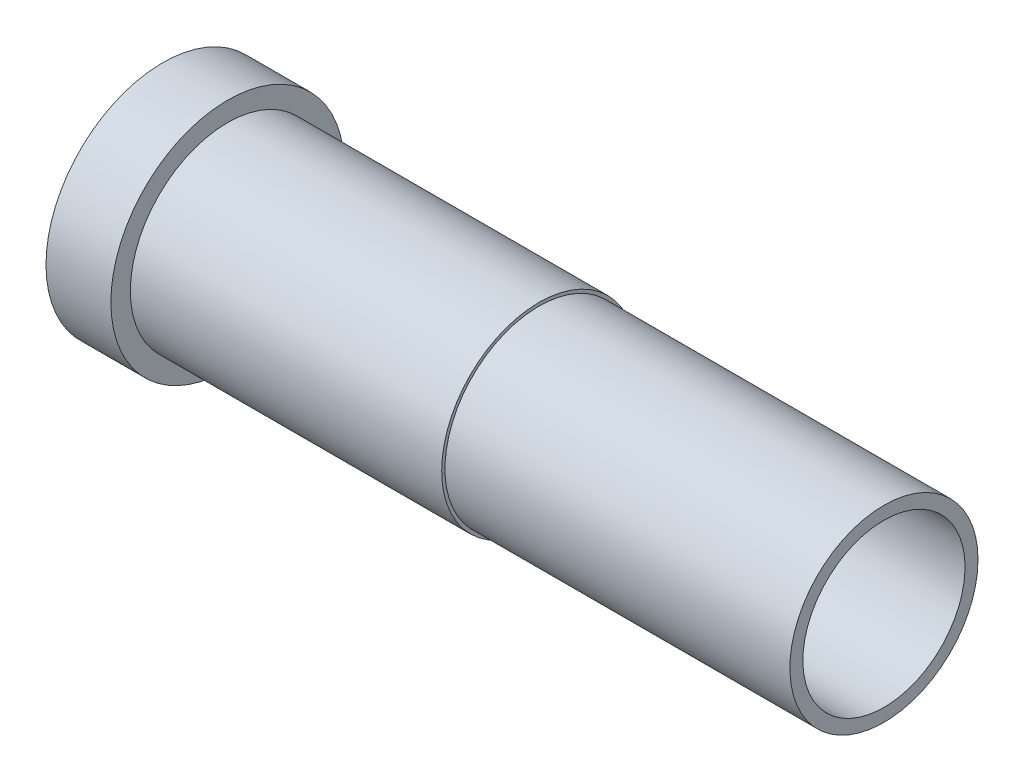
ISO-10303-21;
HEADER;
FILE_DESCRIPTION(('STEP AP214'),'2;1');
FILE_NAME('part.step','',(''),(''),'','','');
FILE_SCHEMA(('AUTOMOTIVE_DESIGN { 1 0 10303 214 1 1 1 1 }'));
ENDSEC;
DATA;
#1=APPLICATION_CONTEXT('core data for automotive mechanical design processes');
#2=APPLICATION_PROTOCOL_DEFINITION('international standard','automotive_design',2000,#1);
#3=PRODUCT_CONTEXT('',#1,'mechanical');
#4=PRODUCT('Part','Part','',(#3));
#5=PRODUCT_RELATED_PRODUCT_CATEGORY('part','',(#4));
#6=PRODUCT_DEFINITION_FORMATION('','',#4);
#7=PRODUCT_DEFINITION_CONTEXT('part definition',#1,'design');
#8=PRODUCT_DEFINITION('design','',#6,#7);
#9=PRODUCT_DEFINITION_SHAPE('','',#8);
#10=(LENGTH_UNIT() NAMED_UNIT(*) SI_UNIT(.MILLI.,.METRE.));
#11=(NAMED_UNIT(*) PLANE_ANGLE_UNIT() SI_UNIT($,.RADIAN.));
#12=(NAMED_UNIT(*) SI_UNIT($,.STERADIAN.) SOLID_ANGLE_UNIT());
#13=UNCERTAINTY_MEASURE_WITH_UNIT(LENGTH_MEASURE(1.E-05),#10,'distance_accuracy_value','');
#14=(GEOMETRIC_REPRESENTATION_CONTEXT(3) GLOBAL_UNCERTAINTY_ASSIGNED_CONTEXT((#13)) GLOBAL_UNIT_ASSIGNED_CONTEXT((#10,
#11,#12)) REPRESENTATION_CONTEXT('',''));
#15=CARTESIAN_POINT('',(0.,0.,0.));
#16=DIRECTION('',(0.,0.,1.));
#17=DIRECTION('',(1.,0.,0.));
#18=AXIS2_PLACEMENT_3D('',#15,#16,#17);
#19=CARTESIAN_POINT('',(-21.6393356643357,0.,0.));
#20=DIRECTION('',(-1.,0.,0.));
#21=DIRECTION('',(0.,0.,1.));
#22=AXIS2_PLACEMENT_3D('',#19,#20,#21);
#23=CYLINDRICAL_SURFACE('',#22,6.25);
#24=CARTESIAN_POINT('',(0.499999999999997,0.,0.));
#25=DIRECTION('',(1.,0.,0.));
#26=DIRECTION('',(0.,0.,-1.));
#27=AXIS2_PLACEMENT_3D('',#24,#25,#26);
#28=CIRCLE('',#27,6.25);
#29=CARTESIAN_POINT('',(0.499999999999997,0.,-6.25));
#30=VERTEX_POINT('',#29);
#31=EDGE_CURVE('E40',#30,#30,#28,.F.);
#32=ORIENTED_EDGE('',*,*,#31,.T.);
#33=EDGE_LOOP('',(#32));
#34=FACE_BOUND('',#33,.T.);
#35=CARTESIAN_POINT('',(55.5866,0.,0.));
#36=DIRECTION('',(1.,0.,0.));
#37=DIRECTION('',(0.,1.,0.));
#38=AXIS2_PLACEMENT_3D('',#35,#36,#37);
#39=CIRCLE('',#38,6.25);
#40=CARTESIAN_POINT('',(55.5866,6.25,0.));
#41=VERTEX_POINT('',#40);
#42=EDGE_CURVE('E58',#41,#41,#39,.F.);
#43=ORIENTED_EDGE('',*,*,#42,.F.);
#44=EDGE_LOOP('',(#43));
#45=FACE_BOUND('',#44,.T.);
#46=ADVANCED_FACE('F32',(#34,#45),#23,.F.);
#47=CARTESIAN_POINT('',(29.,0.,0.));
#48=DIRECTION('',(1.,0.,0.));
#49=DIRECTION('',(0.,0.,-1.));
#50=AXIS2_PLACEMENT_3D('',#47,#48,#49);
#51=CYLINDRICAL_SURFACE('',#50,7.25);
#52=CARTESIAN_POINT('',(29.,0.,0.));
#53=DIRECTION('',(1.,0.,0.));
#54=DIRECTION('',(0.,0.,-1.));
#55=AXIS2_PLACEMENT_3D('',#52,#53,#54);
#56=CIRCLE('',#55,7.25);
#57=CARTESIAN_POINT('',(29.,0.,-7.25));
#58=VERTEX_POINT('',#57);
#59=EDGE_CURVE('E55',#58,#58,#56,.T.);
#60=ORIENTED_EDGE('',*,*,#59,.T.);
#61=EDGE_LOOP('',(#60));
#62=FACE_BOUND('',#61,.T.);
#63=CARTESIAN_POINT('',(55.5866,0.,0.));
#64=DIRECTION('',(1.,0.,0.));
#65=DIRECTION('',(0.,1.,0.));
#66=AXIS2_PLACEMENT_3D('',#63,#64,#65);
#67=CIRCLE('',#66,7.25);
#68=CARTESIAN_POINT('',(55.5866,7.25,0.));
#69=VERTEX_POINT('',#68);
#70=EDGE_CURVE('E61',#69,#69,#67,.F.);
#71=ORIENTED_EDGE('',*,*,#70,.T.);
#72=EDGE_LOOP('',(#71));
#73=FACE_BOUND('',#72,.T.);
#74=ADVANCED_FACE('F65',(#62,#73),#51,.T.);
#75=CARTESIAN_POINT('',(-21.6393356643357,0.,0.));
#76=DIRECTION('',(-1.,0.,0.));
#77=DIRECTION('',(0.,0.,1.));
#78=AXIS2_PLACEMENT_3D('',#75,#76,#77);
#79=CYLINDRICAL_SURFACE('',#78,7.5);
#80=CARTESIAN_POINT('',(5.,0.,0.));
#81=DIRECTION('',(-1.,0.,0.));
#82=DIRECTION('',(0.,0.,1.));
#83=AXIS2_PLACEMENT_3D('',#80,#81,#82);
#84=CIRCLE('',#83,7.5);
#85=CARTESIAN_POINT('',(5.,0.,7.5));
#86=VERTEX_POINT('',#85);
#87=EDGE_CURVE('E52',#86,#86,#84,.T.);
#88=ORIENTED_EDGE('',*,*,#87,.F.);
#89=EDGE_LOOP('',(#88));
#90=FACE_BOUND('',#89,.T.);
#91=CARTESIAN_POINT('',(29.,0.,0.));
#92=DIRECTION('',(1.,0.,0.));
#93=DIRECTION('',(0.,0.,-1.));
#94=AXIS2_PLACEMENT_3D('',#91,#92,#93);
#95=CIRCLE('',#94,7.5);
#96=CARTESIAN_POINT('',(29.,0.,-7.5));
#97=VERTEX_POINT('',#96);
#98=EDGE_CURVE('E36',#97,#97,#95,.T.);
#99=ORIENTED_EDGE('',*,*,#98,.F.);
#100=EDGE_LOOP('',(#99));
#101=FACE_BOUND('',#100,.T.);
#102=ADVANCED_FACE('F79',(#90,#101),#79,.T.);
#103=CARTESIAN_POINT('',(0.,6.24999999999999,0.));
#104=DIRECTION('',(1.,0.,0.));
#105=DIRECTION('',(0.,0.,-1.));
#106=AXIS2_PLACEMENT_3D('',#103,#104,#105);
#107=PLANE('',#106);
#108=CARTESIAN_POINT('',(0.,0.,0.));
#109=DIRECTION('',(1.,0.,0.));
#110=DIRECTION('',(0.,0.,-1.));
#111=AXIS2_PLACEMENT_3D('',#108,#109,#110);
#112=CIRCLE('',#111,6.75);
#113=CARTESIAN_POINT('',(0.,0.,-6.75));
#114=VERTEX_POINT('',#113);
#115=EDGE_CURVE('E11',#114,#114,#112,.T.);
#116=ORIENTED_EDGE('',*,*,#115,.T.);
#117=EDGE_LOOP('',(#116));
#118=FACE_BOUND('',#117,.T.);
#119=CARTESIAN_POINT('',(0.,0.,0.));
#120=DIRECTION('',(-1.,0.,0.));
#121=DIRECTION('',(0.,0.,1.));
#122=AXIS2_PLACEMENT_3D('',#119,#120,#121);
#123=CIRCLE('',#122,9.);
#124=CARTESIAN_POINT('',(0.,0.,9.));
#125=VERTEX_POINT('',#124);
#126=EDGE_CURVE('E44',#125,#125,#123,.T.);
#127=ORIENTED_EDGE('',*,*,#126,.T.);
#128=EDGE_LOOP('',(#127));
#129=FACE_BOUND('',#128,.T.);
#130=ADVANCED_FACE('F83',(#118,#129),#107,.F.);
#131=CARTESIAN_POINT('',(-21.6393356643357,0.,0.));
#132=DIRECTION('',(-1.,0.,0.));
#133=DIRECTION('',(0.,0.,1.));
#134=AXIS2_PLACEMENT_3D('',#131,#132,#133);
#135=CYLINDRICAL_SURFACE('',#134,9.);
#136=ORIENTED_EDGE('',*,*,#126,.F.);
#137=EDGE_LOOP('',(#136));
#138=FACE_BOUND('',#137,.T.);
#139=CARTESIAN_POINT('',(5.,0.,0.));
#140=DIRECTION('',(-1.,0.,0.));
#141=DIRECTION('',(0.,0.,1.));
#142=AXIS2_PLACEMENT_3D('',#139,#140,#141);
#143=CIRCLE('',#142,9.);
#144=CARTESIAN_POINT('',(5.,0.,9.));
#145=VERTEX_POINT('',#144);
#146=EDGE_CURVE('E49',#145,#145,#143,.T.);
#147=ORIENTED_EDGE('',*,*,#146,.T.);
#148=EDGE_LOOP('',(#147));
#149=FACE_BOUND('',#148,.T.);
#150=ADVANCED_FACE('F86',(#138,#149),#135,.T.);
#151=CARTESIAN_POINT('',(5.,9.,0.));
#152=DIRECTION('',(-1.,0.,0.));
#153=DIRECTION('',(0.,0.,1.));
#154=AXIS2_PLACEMENT_3D('',#151,#152,#153);
#155=PLANE('',#154);
#156=ORIENTED_EDGE('',*,*,#146,.F.);
#157=EDGE_LOOP('',(#156));
#158=FACE_BOUND('',#157,.T.);
#159=ORIENTED_EDGE('',*,*,#87,.T.);
#160=EDGE_LOOP('',(#159));
#161=FACE_BOUND('',#160,.T.);
#162=ADVANCED_FACE('F89',(#158,#161),#155,.F.);
#163=CARTESIAN_POINT('',(0.499999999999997,0.,0.));
#164=DIRECTION('',(-1.,0.,0.));
#165=DIRECTION('',(0.,0.,1.));
#166=AXIS2_PLACEMENT_3D('',#163,#164,#165);
#167=CONICAL_SURFACE('',#166,6.25,0.785398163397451);
#168=ORIENTED_EDGE('',*,*,#115,.F.);
#169=EDGE_LOOP('',(#168));
#170=FACE_BOUND('',#169,.T.);
#171=ORIENTED_EDGE('',*,*,#31,.F.);
#172=EDGE_LOOP('',(#171));
#173=FACE_BOUND('',#172,.T.);
#174=ADVANCED_FACE('F34',(#170,#173),#167,.F.);
#175=CARTESIAN_POINT('',(29.,0.,0.));
#176=DIRECTION('',(1.,0.,0.));
#177=DIRECTION('',(0.,0.,-1.));
#178=AXIS2_PLACEMENT_3D('',#175,#176,#177);
#179=PLANE('',#178);
#180=ORIENTED_EDGE('',*,*,#59,.F.);
#181=EDGE_LOOP('',(#180));
#182=FACE_BOUND('',#181,.T.);
#183=ORIENTED_EDGE('',*,*,#98,.T.);
#184=EDGE_LOOP('',(#183));
#185=FACE_BOUND('',#184,.T.);
#186=ADVANCED_FACE('F70',(#182,#185),#179,.T.);
#187=CARTESIAN_POINT('',(55.5866,7.3521209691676,0.));
#188=DIRECTION('',(1.,0.,0.));
#189=DIRECTION('',(0.,0.,1.));
#190=AXIS2_PLACEMENT_3D('',#187,#188,#189);
#191=PLANE('',#190);
#192=ORIENTED_EDGE('',*,*,#70,.F.);
#193=EDGE_LOOP('',(#192));
#194=FACE_BOUND('',#193,.T.);
#195=ORIENTED_EDGE('',*,*,#42,.T.);
#196=EDGE_LOOP('',(#195));
#197=FACE_BOUND('',#196,.T.);
#198=ADVANCED_FACE('F67',(#194,#197),#191,.T.);
#199=CLOSED_SHELL('',(#46,#74,#102,#130,#150,#162,#174,#186,#198));
#200=MANIFOLD_SOLID_BREP('B2',#199);
#201=ADVANCED_BREP_SHAPE_REPRESENTATION('',(#18,#200),#14);
#202=SHAPE_DEFINITION_REPRESENTATION(#9,#201);
ENDSEC;
END-ISO-10303-21;
